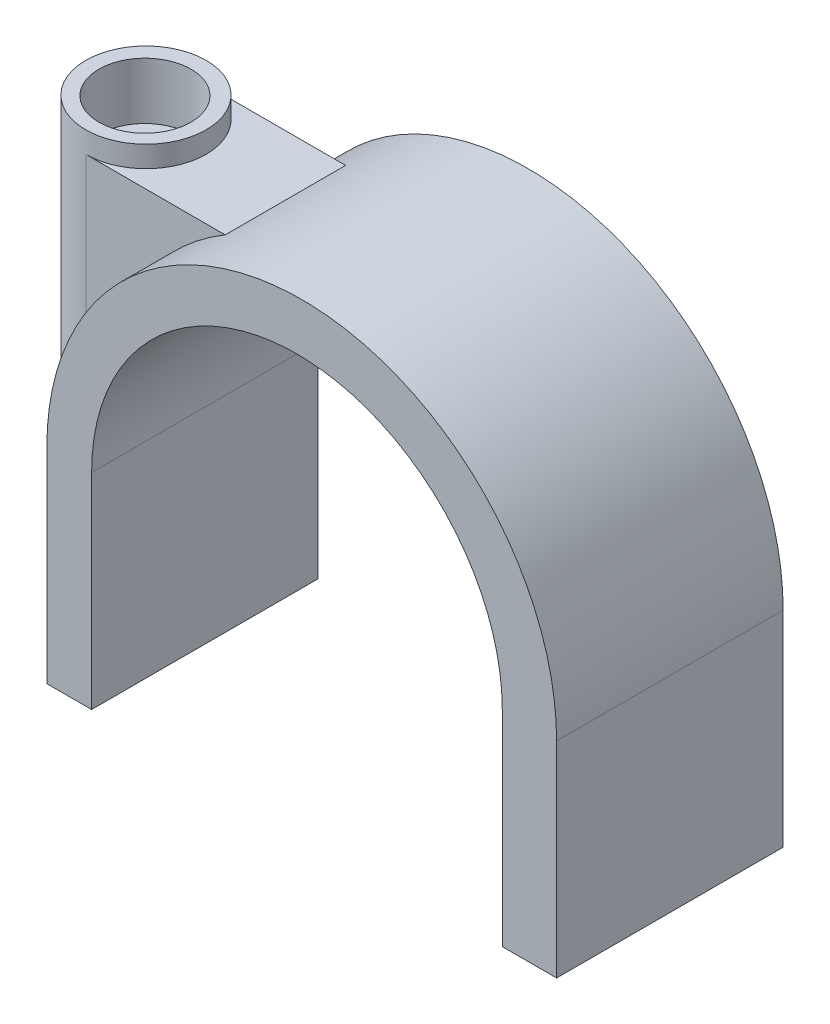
ISO-10303-21;
HEADER;
FILE_DESCRIPTION(('STEP AP214'),'2;1');
FILE_NAME('part.step','',(''),(''),'','','');
FILE_SCHEMA(('AUTOMOTIVE_DESIGN { 1 0 10303 214 1 1 1 1 }'));
ENDSEC;
DATA;
#1=APPLICATION_CONTEXT('core data for automotive mechanical design processes');
#2=APPLICATION_PROTOCOL_DEFINITION('international standard','automotive_design',2000,#1);
#3=PRODUCT_CONTEXT('',#1,'mechanical');
#4=PRODUCT('Part','Part','',(#3));
#5=PRODUCT_RELATED_PRODUCT_CATEGORY('part','',(#4));
#6=PRODUCT_DEFINITION_FORMATION('','',#4);
#7=PRODUCT_DEFINITION_CONTEXT('part definition',#1,'design');
#8=PRODUCT_DEFINITION('design','',#6,#7);
#9=PRODUCT_DEFINITION_SHAPE('','',#8);
#10=(LENGTH_UNIT() NAMED_UNIT(*) SI_UNIT(.MILLI.,.METRE.));
#11=(NAMED_UNIT(*) PLANE_ANGLE_UNIT() SI_UNIT($,.RADIAN.));
#12=(NAMED_UNIT(*) SI_UNIT($,.STERADIAN.) SOLID_ANGLE_UNIT());
#13=UNCERTAINTY_MEASURE_WITH_UNIT(LENGTH_MEASURE(1.E-05),#10,'distance_accuracy_value','');
#14=(GEOMETRIC_REPRESENTATION_CONTEXT(3) GLOBAL_UNCERTAINTY_ASSIGNED_CONTEXT((#13)) GLOBAL_UNIT_ASSIGNED_CONTEXT((#10,
#11,#12)) REPRESENTATION_CONTEXT('',''));
#15=CARTESIAN_POINT('',(0.,0.,0.));
#16=DIRECTION('',(0.,0.,1.));
#17=DIRECTION('',(1.,0.,0.));
#18=AXIS2_PLACEMENT_3D('',#15,#16,#17);
#19=CARTESIAN_POINT('',(32.5,0.,16.));
#20=DIRECTION('',(0.,1.,0.));
#21=DIRECTION('',(0.,0.,1.));
#22=AXIS2_PLACEMENT_3D('',#19,#20,#21);
#23=PLANE('',#22);
#24=CARTESIAN_POINT('',(-1.,0.,8.));
#25=DIRECTION('',(0.,1.,0.));
#26=DIRECTION('',(0.,0.,1.));
#27=AXIS2_PLACEMENT_3D('',#24,#25,#26);
#28=CIRCLE('',#27,1.25);
#29=CARTESIAN_POINT('',(-1.,0.,9.25));
#30=VERTEX_POINT('',#29);
#31=EDGE_CURVE('E408',#30,#30,#28,.T.);
#32=ORIENTED_EDGE('',*,*,#31,.T.);
#33=EDGE_LOOP('',(#32));
#34=FACE_BOUND('',#33,.T.);
#35=DIRECTION('',(0.,0.,-1.));
#36=VECTOR('',#35,1.);
#37=CARTESIAN_POINT('',(3.16258169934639,0.,16.));
#38=LINE('',#37,#36);
#39=CARTESIAN_POINT('',(3.16258169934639,0.,16.));
#40=VERTEX_POINT('',#39);
#41=CARTESIAN_POINT('',(3.16258169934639,0.,0.));
#42=VERTEX_POINT('',#41);
#43=EDGE_CURVE('E132',#40,#42,#38,.T.);
#44=ORIENTED_EDGE('',*,*,#43,.F.);
#45=DIRECTION('',(1.,0.,0.));
#46=VECTOR('',#45,1.);
#47=CARTESIAN_POINT('',(0.,0.,16.));
#48=LINE('',#47,#46);
#49=CARTESIAN_POINT('',(0.,0.,16.));
#50=VERTEX_POINT('',#49);
#51=EDGE_CURVE('E213',#50,#40,#48,.T.);
#52=ORIENTED_EDGE('',*,*,#51,.F.);
#53=DIRECTION('',(0.,0.,-1.));
#54=VECTOR('',#53,1.);
#55=CARTESIAN_POINT('',(0.,0.,16.));
#56=LINE('',#55,#54);
#57=CARTESIAN_POINT('',(0.,0.,12.25));
#58=VERTEX_POINT('',#57);
#59=EDGE_CURVE('E38',#50,#58,#56,.T.);
#60=ORIENTED_EDGE('',*,*,#59,.T.);
#61=DIRECTION('',(-1.,0.,0.));
#62=VECTOR('',#61,1.);
#63=CARTESIAN_POINT('',(36.001,0.,12.25));
#64=LINE('',#63,#62);
#65=CARTESIAN_POINT('',(-1.,0.,12.25));
#66=VERTEX_POINT('',#65);
#67=EDGE_CURVE('E141',#58,#66,#64,.T.);
#68=ORIENTED_EDGE('',*,*,#67,.T.);
#69=CARTESIAN_POINT('',(-1.,0.,8.));
#70=DIRECTION('',(0.,-1.,0.));
#71=DIRECTION('',(0.,0.,-1.));
#72=AXIS2_PLACEMENT_3D('',#69,#70,#71);
#73=CIRCLE('',#72,4.25);
#74=CARTESIAN_POINT('',(-1.,0.,3.75));
#75=VERTEX_POINT('',#74);
#76=EDGE_CURVE('E193',#66,#75,#73,.T.);
#77=ORIENTED_EDGE('',*,*,#76,.T.);
#78=DIRECTION('',(-1.,0.,0.));
#79=VECTOR('',#78,1.);
#80=CARTESIAN_POINT('',(36.001,0.,3.75));
#81=LINE('',#80,#79);
#82=CARTESIAN_POINT('',(0.,0.,3.75));
#83=VERTEX_POINT('',#82);
#84=EDGE_CURVE('E175',#83,#75,#81,.T.);
#85=ORIENTED_EDGE('',*,*,#84,.F.);
#86=CARTESIAN_POINT('',(0.,0.,0.));
#87=VERTEX_POINT('',#86);
#88=EDGE_CURVE('E53',#83,#87,#56,.T.);
#89=ORIENTED_EDGE('',*,*,#88,.T.);
#90=DIRECTION('',(1.,0.,0.));
#91=VECTOR('',#90,1.);
#92=CARTESIAN_POINT('',(32.5,0.,0.));
#93=LINE('',#92,#91);
#94=EDGE_CURVE('E202',#87,#42,#93,.T.);
#95=ORIENTED_EDGE('',*,*,#94,.T.);
#96=EDGE_LOOP('',(#44,#52,#60,#68,#77,#85,#89,#95));
#97=FACE_BOUND('',#96,.T.);
#98=ADVANCED_FACE('F30',(#34,#97),#23,.F.);
#99=DIRECTION('',(0.,0.,-1.));
#100=VECTOR('',#99,1.);
#101=CARTESIAN_POINT('',(32.1625816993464,0.,16.));
#102=LINE('',#101,#100);
#103=CARTESIAN_POINT('',(32.1625816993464,0.,16.));
#104=VERTEX_POINT('',#103);
#105=CARTESIAN_POINT('',(32.1625816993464,0.,0.));
#106=VERTEX_POINT('',#105);
#107=EDGE_CURVE('E161',#104,#106,#102,.T.);
#108=ORIENTED_EDGE('',*,*,#107,.T.);
#109=CARTESIAN_POINT('',(36.,0.,0.));
#110=VERTEX_POINT('',#109);
#111=EDGE_CURVE('E201',#106,#110,#93,.T.);
#112=ORIENTED_EDGE('',*,*,#111,.T.);
#113=DIRECTION('',(0.,0.,-1.));
#114=VECTOR('',#113,1.);
#115=CARTESIAN_POINT('',(36.,0.,16.));
#116=LINE('',#115,#114);
#117=CARTESIAN_POINT('',(36.,0.,16.));
#118=VERTEX_POINT('',#117);
#119=EDGE_CURVE('E227',#118,#110,#116,.T.);
#120=ORIENTED_EDGE('',*,*,#119,.F.);
#121=EDGE_CURVE('E212',#104,#118,#48,.T.);
#122=ORIENTED_EDGE('',*,*,#121,.F.);
#123=EDGE_LOOP('',(#108,#112,#120,#122));
#124=FACE_BOUND('',#123,.T.);
#125=ADVANCED_FACE('F248',(#124),#23,.F.);
#126=CARTESIAN_POINT('',(18.,14.5,16.));
#127=DIRECTION('',(0.,0.,1.));
#128=DIRECTION('',(1.,0.,0.));
#129=AXIS2_PLACEMENT_3D('',#126,#127,#128);
#130=PLANE('',#129);
#131=ORIENTED_EDGE('',*,*,#51,.T.);
#132=DIRECTION('',(0.,-1.,0.));
#133=VECTOR('',#132,1.);
#134=CARTESIAN_POINT('',(3.16258169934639,0.,16.));
#135=LINE('',#134,#133);
#136=CARTESIAN_POINT('',(3.16258169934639,14.5,16.));
#137=VERTEX_POINT('',#136);
#138=EDGE_CURVE('E155',#137,#40,#135,.T.);
#139=ORIENTED_EDGE('',*,*,#138,.F.);
#140=CARTESIAN_POINT('',(17.6625816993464,14.5,16.));
#141=DIRECTION('',(0.,0.,1.));
#142=DIRECTION('',(1.,0.,0.));
#143=AXIS2_PLACEMENT_3D('',#140,#141,#142);
#144=CIRCLE('',#143,14.5);
#145=CARTESIAN_POINT('',(32.1625816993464,14.5,16.));
#146=VERTEX_POINT('',#145);
#147=EDGE_CURVE('E140',#146,#137,#144,.T.);
#148=ORIENTED_EDGE('',*,*,#147,.F.);
#149=DIRECTION('',(0.,1.,0.));
#150=VECTOR('',#149,1.);
#151=CARTESIAN_POINT('',(32.1625816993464,14.5,16.));
#152=LINE('',#151,#150);
#153=EDGE_CURVE('E157',#104,#146,#152,.T.);
#154=ORIENTED_EDGE('',*,*,#153,.F.);
#155=ORIENTED_EDGE('',*,*,#121,.T.);
#156=DIRECTION('',(0.,1.,0.));
#157=VECTOR('',#156,1.);
#158=CARTESIAN_POINT('',(36.,0.,16.));
#159=LINE('',#158,#157);
#160=CARTESIAN_POINT('',(36.,14.5,16.));
#161=VERTEX_POINT('',#160);
#162=EDGE_CURVE('E216',#118,#161,#159,.T.);
#163=ORIENTED_EDGE('',*,*,#162,.T.);
#164=CARTESIAN_POINT('',(18.,14.5,16.));
#165=DIRECTION('',(0.,0.,1.));
#166=DIRECTION('',(1.,0.,0.));
#167=AXIS2_PLACEMENT_3D('',#164,#165,#166);
#168=CIRCLE('',#167,18.);
#169=CARTESIAN_POINT('',(0.,14.5,16.));
#170=VERTEX_POINT('',#169);
#171=EDGE_CURVE('E218',#161,#170,#168,.T.);
#172=ORIENTED_EDGE('',*,*,#171,.T.);
#173=DIRECTION('',(0.,-1.,0.));
#174=VECTOR('',#173,1.);
#175=CARTESIAN_POINT('',(0.,0.,16.));
#176=LINE('',#175,#174);
#177=EDGE_CURVE('E209',#170,#50,#176,.T.);
#178=ORIENTED_EDGE('',*,*,#177,.T.);
#179=EDGE_LOOP('',(#131,#139,#148,#154,#155,#163,#172,#178));
#180=FACE_BOUND('',#179,.T.);
#181=ADVANCED_FACE('F253',(#180),#130,.T.);
#182=CARTESIAN_POINT('',(18.,14.5,0.));
#183=DIRECTION('',(0.,0.,1.));
#184=DIRECTION('',(1.,0.,0.));
#185=AXIS2_PLACEMENT_3D('',#182,#183,#184);
#186=PLANE('',#185);
#187=DIRECTION('',(0.,-1.,0.));
#188=VECTOR('',#187,1.);
#189=CARTESIAN_POINT('',(3.16258169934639,0.,0.));
#190=LINE('',#189,#188);
#191=CARTESIAN_POINT('',(3.16258169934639,14.5,0.));
#192=VERTEX_POINT('',#191);
#193=EDGE_CURVE('E127',#192,#42,#190,.T.);
#194=ORIENTED_EDGE('',*,*,#193,.T.);
#195=ORIENTED_EDGE('',*,*,#94,.F.);
#196=DIRECTION('',(0.,-1.,0.));
#197=VECTOR('',#196,1.);
#198=CARTESIAN_POINT('',(0.,0.,0.));
#199=LINE('',#198,#197);
#200=CARTESIAN_POINT('',(0.,14.5,0.));
#201=VERTEX_POINT('',#200);
#202=EDGE_CURVE('E199',#201,#87,#199,.T.);
#203=ORIENTED_EDGE('',*,*,#202,.F.);
#204=CARTESIAN_POINT('',(18.,14.5,0.));
#205=DIRECTION('',(0.,0.,1.));
#206=DIRECTION('',(1.,0.,0.));
#207=AXIS2_PLACEMENT_3D('',#204,#205,#206);
#208=CIRCLE('',#207,18.);
#209=CARTESIAN_POINT('',(36.,14.5,0.));
#210=VERTEX_POINT('',#209);
#211=EDGE_CURVE('E206',#210,#201,#208,.T.);
#212=ORIENTED_EDGE('',*,*,#211,.F.);
#213=DIRECTION('',(0.,1.,0.));
#214=VECTOR('',#213,1.);
#215=CARTESIAN_POINT('',(36.,0.,0.));
#216=LINE('',#215,#214);
#217=EDGE_CURVE('E204',#110,#210,#216,.T.);
#218=ORIENTED_EDGE('',*,*,#217,.F.);
#219=ORIENTED_EDGE('',*,*,#111,.F.);
#220=DIRECTION('',(0.,1.,0.));
#221=VECTOR('',#220,1.);
#222=CARTESIAN_POINT('',(32.1625816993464,14.5,0.));
#223=LINE('',#222,#221);
#224=CARTESIAN_POINT('',(32.1625816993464,14.5,0.));
#225=VERTEX_POINT('',#224);
#226=EDGE_CURVE('E136',#106,#225,#223,.T.);
#227=ORIENTED_EDGE('',*,*,#226,.T.);
#228=CARTESIAN_POINT('',(17.6625816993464,14.5,0.));
#229=DIRECTION('',(0.,0.,1.));
#230=DIRECTION('',(1.,0.,0.));
#231=AXIS2_PLACEMENT_3D('',#228,#229,#230);
#232=CIRCLE('',#231,14.5);
#233=EDGE_CURVE('E45',#225,#192,#232,.T.);
#234=ORIENTED_EDGE('',*,*,#233,.T.);
#235=EDGE_LOOP('',(#194,#195,#203,#212,#218,#219,#227,#234));
#236=FACE_BOUND('',#235,.T.);
#237=ADVANCED_FACE('F144',(#236),#186,.F.);
#238=CARTESIAN_POINT('',(0.,0.,16.));
#239=DIRECTION('',(1.,0.,0.));
#240=DIRECTION('',(0.,0.,-1.));
#241=AXIS2_PLACEMENT_3D('',#238,#239,#240);
#242=PLANE('',#241);
#243=DIRECTION('',(0.,0.,-1.));
#244=VECTOR('',#243,1.);
#245=CARTESIAN_POINT('',(0.,14.5,16.));
#246=LINE('',#245,#244);
#247=CARTESIAN_POINT('',(0.,14.5,12.25));
#248=VERTEX_POINT('',#247);
#249=EDGE_CURVE('E221',#170,#248,#246,.T.);
#250=ORIENTED_EDGE('',*,*,#249,.T.);
#251=DIRECTION('',(0.,-1.,0.));
#252=VECTOR('',#251,1.);
#253=CARTESIAN_POINT('',(0.,0.,12.25));
#254=LINE('',#253,#252);
#255=EDGE_CURVE('E167',#248,#58,#254,.T.);
#256=ORIENTED_EDGE('',*,*,#255,.T.);
#257=ORIENTED_EDGE('',*,*,#59,.F.);
#258=ORIENTED_EDGE('',*,*,#177,.F.);
#259=EDGE_LOOP('',(#250,#256,#257,#258));
#260=FACE_BOUND('',#259,.T.);
#261=ADVANCED_FACE('F257',(#260),#242,.F.);
#262=ORIENTED_EDGE('',*,*,#88,.F.);
#263=DIRECTION('',(0.,1.,0.));
#264=VECTOR('',#263,1.);
#265=CARTESIAN_POINT('',(0.,0.,3.75));
#266=LINE('',#265,#264);
#267=CARTESIAN_POINT('',(0.,14.5,3.75));
#268=VERTEX_POINT('',#267);
#269=EDGE_CURVE('E191',#83,#268,#266,.T.);
#270=ORIENTED_EDGE('',*,*,#269,.T.);
#271=EDGE_CURVE('E220',#268,#201,#246,.T.);
#272=ORIENTED_EDGE('',*,*,#271,.T.);
#273=ORIENTED_EDGE('',*,*,#202,.T.);
#274=EDGE_LOOP('',(#262,#270,#272,#273));
#275=FACE_BOUND('',#274,.T.);
#276=ADVANCED_FACE('F32',(#275),#242,.F.);
#277=CARTESIAN_POINT('',(36.,0.,16.));
#278=DIRECTION('',(-1.,0.,0.));
#279=DIRECTION('',(0.,0.,1.));
#280=AXIS2_PLACEMENT_3D('',#277,#278,#279);
#281=PLANE('',#280);
#282=ORIENTED_EDGE('',*,*,#217,.T.);
#283=DIRECTION('',(0.,0.,-1.));
#284=VECTOR('',#283,1.);
#285=CARTESIAN_POINT('',(36.,14.5,16.));
#286=LINE('',#285,#284);
#287=EDGE_CURVE('E224',#161,#210,#286,.T.);
#288=ORIENTED_EDGE('',*,*,#287,.F.);
#289=ORIENTED_EDGE('',*,*,#162,.F.);
#290=ORIENTED_EDGE('',*,*,#119,.T.);
#291=EDGE_LOOP('',(#282,#288,#289,#290));
#292=FACE_BOUND('',#291,.T.);
#293=ADVANCED_FACE('F243',(#292),#281,.F.);
#294=CARTESIAN_POINT('',(18.,14.5,16.));
#295=DIRECTION('',(0.,0.,-1.));
#296=DIRECTION('',(-1.,0.,0.));
#297=AXIS2_PLACEMENT_3D('',#294,#295,#296);
#298=CYLINDRICAL_SURFACE('',#297,18.);
#299=ORIENTED_EDGE('',*,*,#271,.F.);
#300=CARTESIAN_POINT('',(18.,14.5,3.75));
#301=DIRECTION('',(0.,0.,-1.));
#302=DIRECTION('',(-1.,0.,0.));
#303=AXIS2_PLACEMENT_3D('',#300,#301,#302);
#304=CIRCLE('',#303,18.);
#305=CARTESIAN_POINT('',(8.84849739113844,30.,3.75));
#306=VERTEX_POINT('',#305);
#307=EDGE_CURVE('E178',#306,#268,#304,.F.);
#308=ORIENTED_EDGE('',*,*,#307,.F.);
#309=DIRECTION('',(0.,0.,-1.));
#310=VECTOR('',#309,1.);
#311=CARTESIAN_POINT('',(8.84849739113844,30.,16.));
#312=LINE('',#311,#310);
#313=CARTESIAN_POINT('',(8.84849739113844,30.,12.25));
#314=VERTEX_POINT('',#313);
#315=EDGE_CURVE('E171',#314,#306,#312,.T.);
#316=ORIENTED_EDGE('',*,*,#315,.F.);
#317=CARTESIAN_POINT('',(18.,14.5,12.25));
#318=DIRECTION('',(0.,0.,1.));
#319=DIRECTION('',(0.,-1.,0.));
#320=AXIS2_PLACEMENT_3D('',#317,#318,#319);
#321=CIRCLE('',#320,18.);
#322=EDGE_CURVE('E185',#248,#314,#321,.F.);
#323=ORIENTED_EDGE('',*,*,#322,.F.);
#324=ORIENTED_EDGE('',*,*,#249,.F.);
#325=ORIENTED_EDGE('',*,*,#171,.F.);
#326=ORIENTED_EDGE('',*,*,#287,.T.);
#327=ORIENTED_EDGE('',*,*,#211,.T.);
#328=EDGE_LOOP('',(#299,#308,#316,#323,#324,#325,#326,#327));
#329=FACE_BOUND('',#328,.T.);
#330=ADVANCED_FACE('F238',(#329),#298,.T.);
#331=CARTESIAN_POINT('',(-1.,31.5,8.));
#332=DIRECTION('',(0.,-1.,0.));
#333=DIRECTION('',(0.,0.,-1.));
#334=AXIS2_PLACEMENT_3D('',#331,#332,#333);
#335=CYLINDRICAL_SURFACE('',#334,4.25);
#336=DIRECTION('',(0.,-1.,0.));
#337=VECTOR('',#336,1.);
#338=CARTESIAN_POINT('',(-1.,0.,3.75));
#339=LINE('',#338,#337);
#340=CARTESIAN_POINT('',(-1.,30.,3.75));
#341=VERTEX_POINT('',#340);
#342=EDGE_CURVE('E165',#341,#75,#339,.T.);
#343=ORIENTED_EDGE('',*,*,#342,.T.);
#344=ORIENTED_EDGE('',*,*,#76,.F.);
#345=DIRECTION('',(0.,1.,0.));
#346=VECTOR('',#345,1.);
#347=CARTESIAN_POINT('',(-1.,30.,12.25));
#348=LINE('',#347,#346);
#349=CARTESIAN_POINT('',(-1.,30.,12.25));
#350=VERTEX_POINT('',#349);
#351=EDGE_CURVE('E168',#66,#350,#348,.T.);
#352=ORIENTED_EDGE('',*,*,#351,.T.);
#353=CARTESIAN_POINT('',(-1.,30.,8.));
#354=DIRECTION('',(0.,1.,0.));
#355=DIRECTION('',(0.,0.,1.));
#356=AXIS2_PLACEMENT_3D('',#353,#354,#355);
#357=CIRCLE('',#356,4.25);
#358=EDGE_CURVE('E11',#341,#350,#357,.F.);
#359=ORIENTED_EDGE('',*,*,#358,.F.);
#360=EDGE_LOOP('',(#343,#344,#352,#359));
#361=FACE_BOUND('',#360,.T.);
#362=CARTESIAN_POINT('',(-1.,31.5,8.));
#363=DIRECTION('',(0.,-1.,0.));
#364=DIRECTION('',(0.,0.,-1.));
#365=AXIS2_PLACEMENT_3D('',#362,#363,#364);
#366=CIRCLE('',#365,4.25);
#367=CARTESIAN_POINT('',(-1.,31.5,3.75));
#368=VERTEX_POINT('',#367);
#369=EDGE_CURVE('E196',#368,#368,#366,.T.);
#370=ORIENTED_EDGE('',*,*,#369,.T.);
#371=EDGE_LOOP('',(#370));
#372=FACE_BOUND('',#371,.T.);
#373=ADVANCED_FACE('F270',(#361,#372),#335,.T.);
#374=CARTESIAN_POINT('',(-1.,31.5,8.));
#375=DIRECTION('',(0.,-1.,0.));
#376=DIRECTION('',(0.,0.,-1.));
#377=AXIS2_PLACEMENT_3D('',#374,#375,#376);
#378=PLANE('',#377);
#379=CARTESIAN_POINT('',(-1.,31.5,8.07305693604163));
#380=DIRECTION('',(0.,1.,0.));
#381=DIRECTION('',(0.,0.,1.));
#382=AXIS2_PLACEMENT_3D('',#379,#380,#381);
#383=CIRCLE('',#382,3.25);
#384=CARTESIAN_POINT('',(-1.,31.5,11.3230569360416));
#385=VERTEX_POINT('',#384);
#386=EDGE_CURVE('E149',#385,#385,#383,.T.);
#387=ORIENTED_EDGE('',*,*,#386,.F.);
#388=EDGE_LOOP('',(#387));
#389=FACE_BOUND('',#388,.T.);
#390=ORIENTED_EDGE('',*,*,#369,.F.);
#391=EDGE_LOOP('',(#390));
#392=FACE_BOUND('',#391,.T.);
#393=ADVANCED_FACE('F273',(#389,#392),#378,.F.);
#394=CARTESIAN_POINT('',(36.001,0.,3.75));
#395=DIRECTION('',(0.,0.,-1.));
#396=DIRECTION('',(-1.,0.,0.));
#397=AXIS2_PLACEMENT_3D('',#394,#395,#396);
#398=PLANE('',#397);
#399=ORIENTED_EDGE('',*,*,#269,.F.);
#400=ORIENTED_EDGE('',*,*,#84,.T.);
#401=ORIENTED_EDGE('',*,*,#342,.F.);
#402=DIRECTION('',(-1.,0.,0.));
#403=VECTOR('',#402,1.);
#404=CARTESIAN_POINT('',(36.001,30.,3.75));
#405=LINE('',#404,#403);
#406=EDGE_CURVE('E174',#306,#341,#405,.T.);
#407=ORIENTED_EDGE('',*,*,#406,.F.);
#408=ORIENTED_EDGE('',*,*,#307,.T.);
#409=EDGE_LOOP('',(#399,#400,#401,#407,#408));
#410=FACE_BOUND('',#409,.T.);
#411=ADVANCED_FACE('F266',(#410),#398,.T.);
#412=CARTESIAN_POINT('',(36.001,30.,12.25));
#413=DIRECTION('',(0.,0.,1.));
#414=DIRECTION('',(0.,-1.,0.));
#415=AXIS2_PLACEMENT_3D('',#412,#413,#414);
#416=PLANE('',#415);
#417=ORIENTED_EDGE('',*,*,#255,.F.);
#418=ORIENTED_EDGE('',*,*,#322,.T.);
#419=DIRECTION('',(-1.,0.,0.));
#420=VECTOR('',#419,1.);
#421=CARTESIAN_POINT('',(36.001,30.,12.25));
#422=LINE('',#421,#420);
#423=EDGE_CURVE('E170',#314,#350,#422,.T.);
#424=ORIENTED_EDGE('',*,*,#423,.T.);
#425=ORIENTED_EDGE('',*,*,#351,.F.);
#426=ORIENTED_EDGE('',*,*,#67,.F.);
#427=EDGE_LOOP('',(#417,#418,#424,#425,#426));
#428=FACE_BOUND('',#427,.T.);
#429=ADVANCED_FACE('F260',(#428),#416,.T.);
#430=CARTESIAN_POINT('',(36.001,30.,3.75));
#431=DIRECTION('',(0.,1.,0.));
#432=DIRECTION('',(0.,0.,1.));
#433=AXIS2_PLACEMENT_3D('',#430,#431,#432);
#434=PLANE('',#433);
#435=ORIENTED_EDGE('',*,*,#406,.T.);
#436=ORIENTED_EDGE('',*,*,#358,.T.);
#437=ORIENTED_EDGE('',*,*,#423,.F.);
#438=ORIENTED_EDGE('',*,*,#315,.T.);
#439=EDGE_LOOP('',(#435,#436,#437,#438));
#440=FACE_BOUND('',#439,.T.);
#441=ADVANCED_FACE('F269',(#440),#434,.T.);
#442=CARTESIAN_POINT('',(17.6625816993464,14.5,16.));
#443=DIRECTION('',(0.,0.,-1.));
#444=DIRECTION('',(-1.,0.,0.));
#445=AXIS2_PLACEMENT_3D('',#442,#443,#444);
#446=CYLINDRICAL_SURFACE('',#445,14.5);
#447=ORIENTED_EDGE('',*,*,#233,.F.);
#448=DIRECTION('',(0.,0.,-1.));
#449=VECTOR('',#448,1.);
#450=CARTESIAN_POINT('',(32.1625816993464,14.5,16.));
#451=LINE('',#450,#449);
#452=EDGE_CURVE('E159',#146,#225,#451,.T.);
#453=ORIENTED_EDGE('',*,*,#452,.F.);
#454=ORIENTED_EDGE('',*,*,#147,.T.);
#455=DIRECTION('',(0.,0.,-1.));
#456=VECTOR('',#455,1.);
#457=CARTESIAN_POINT('',(3.16258169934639,14.5,16.));
#458=LINE('',#457,#456);
#459=EDGE_CURVE('E129',#137,#192,#458,.T.);
#460=ORIENTED_EDGE('',*,*,#459,.T.);
#461=EDGE_LOOP('',(#447,#453,#454,#460));
#462=FACE_BOUND('',#461,.T.);
#463=ADVANCED_FACE('F138',(#462),#446,.F.);
#464=CARTESIAN_POINT('',(3.16258169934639,0.,16.));
#465=DIRECTION('',(1.,0.,0.));
#466=DIRECTION('',(0.,0.,-1.));
#467=AXIS2_PLACEMENT_3D('',#464,#465,#466);
#468=PLANE('',#467);
#469=ORIENTED_EDGE('',*,*,#193,.F.);
#470=ORIENTED_EDGE('',*,*,#459,.F.);
#471=ORIENTED_EDGE('',*,*,#138,.T.);
#472=ORIENTED_EDGE('',*,*,#43,.T.);
#473=EDGE_LOOP('',(#469,#470,#471,#472));
#474=FACE_BOUND('',#473,.T.);
#475=ADVANCED_FACE('F128',(#474),#468,.T.);
#476=CARTESIAN_POINT('',(32.1625816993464,14.5,16.));
#477=DIRECTION('',(-1.,0.,0.));
#478=DIRECTION('',(0.,-1.,0.));
#479=AXIS2_PLACEMENT_3D('',#476,#477,#478);
#480=PLANE('',#479);
#481=ORIENTED_EDGE('',*,*,#226,.F.);
#482=ORIENTED_EDGE('',*,*,#107,.F.);
#483=ORIENTED_EDGE('',*,*,#153,.T.);
#484=ORIENTED_EDGE('',*,*,#452,.T.);
#485=EDGE_LOOP('',(#481,#482,#483,#484));
#486=FACE_BOUND('',#485,.T.);
#487=ADVANCED_FACE('F251',(#486),#480,.T.);
#488=CARTESIAN_POINT('',(-1.,27.5,8.07305693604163));
#489=DIRECTION('',(0.,1.,0.));
#490=DIRECTION('',(0.,0.,1.));
#491=AXIS2_PLACEMENT_3D('',#488,#489,#490);
#492=CYLINDRICAL_SURFACE('',#491,3.25);
#493=CARTESIAN_POINT('',(-1.,27.5,8.07305693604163));
#494=DIRECTION('',(0.,1.,0.));
#495=DIRECTION('',(0.,0.,1.));
#496=AXIS2_PLACEMENT_3D('',#493,#494,#495);
#497=CIRCLE('',#496,3.25);
#498=CARTESIAN_POINT('',(-1.,27.5,11.3230569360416));
#499=VERTEX_POINT('',#498);
#500=EDGE_CURVE('E146',#499,#499,#497,.T.);
#501=ORIENTED_EDGE('',*,*,#500,.F.);
#502=EDGE_LOOP('',(#501));
#503=FACE_BOUND('',#502,.T.);
#504=ORIENTED_EDGE('',*,*,#386,.T.);
#505=EDGE_LOOP('',(#504));
#506=FACE_BOUND('',#505,.T.);
#507=ADVANCED_FACE('F373',(#503,#506),#492,.F.);
#508=CARTESIAN_POINT('',(-1.,27.5,8.07305693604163));
#509=DIRECTION('',(0.,1.,0.));
#510=DIRECTION('',(0.,0.,1.));
#511=AXIS2_PLACEMENT_3D('',#508,#509,#510);
#512=PLANE('',#511);
#513=CARTESIAN_POINT('',(-1.,27.5,8.));
#514=DIRECTION('',(0.,1.,0.));
#515=DIRECTION('',(0.,0.,1.));
#516=AXIS2_PLACEMENT_3D('',#513,#514,#515);
#517=CIRCLE('',#516,1.25);
#518=CARTESIAN_POINT('',(-1.,27.5,9.25));
#519=VERTEX_POINT('',#518);
#520=EDGE_CURVE('E411',#519,#519,#517,.T.);
#521=ORIENTED_EDGE('',*,*,#520,.F.);
#522=EDGE_LOOP('',(#521));
#523=FACE_BOUND('',#522,.T.);
#524=ORIENTED_EDGE('',*,*,#500,.T.);
#525=EDGE_LOOP('',(#524));
#526=FACE_BOUND('',#525,.T.);
#527=ADVANCED_FACE('F382',(#523,#526),#512,.T.);
#528=CARTESIAN_POINT('',(-1.,0.,8.));
#529=DIRECTION('',(0.,1.,0.));
#530=DIRECTION('',(0.,0.,1.));
#531=AXIS2_PLACEMENT_3D('',#528,#529,#530);
#532=CYLINDRICAL_SURFACE('',#531,1.25);
#533=ORIENTED_EDGE('',*,*,#31,.F.);
#534=EDGE_LOOP('',(#533));
#535=FACE_BOUND('',#534,.T.);
#536=ORIENTED_EDGE('',*,*,#520,.T.);
#537=EDGE_LOOP('',(#536));
#538=FACE_BOUND('',#537,.T.);
#539=ADVANCED_FACE('F392',(#535,#538),#532,.F.);
#540=CLOSED_SHELL('',(#98,#125,#181,#237,#261,#276,#293,#330,#373,#393,#411,#429,#441,#463,#475,
#487,#507,#527,#539));
#541=MANIFOLD_SOLID_BREP('B2',#540);
#542=ADVANCED_BREP_SHAPE_REPRESENTATION('',(#18,#541),#14);
#543=SHAPE_DEFINITION_REPRESENTATION(#9,#542);
ENDSEC;
END-ISO-10303-21;
